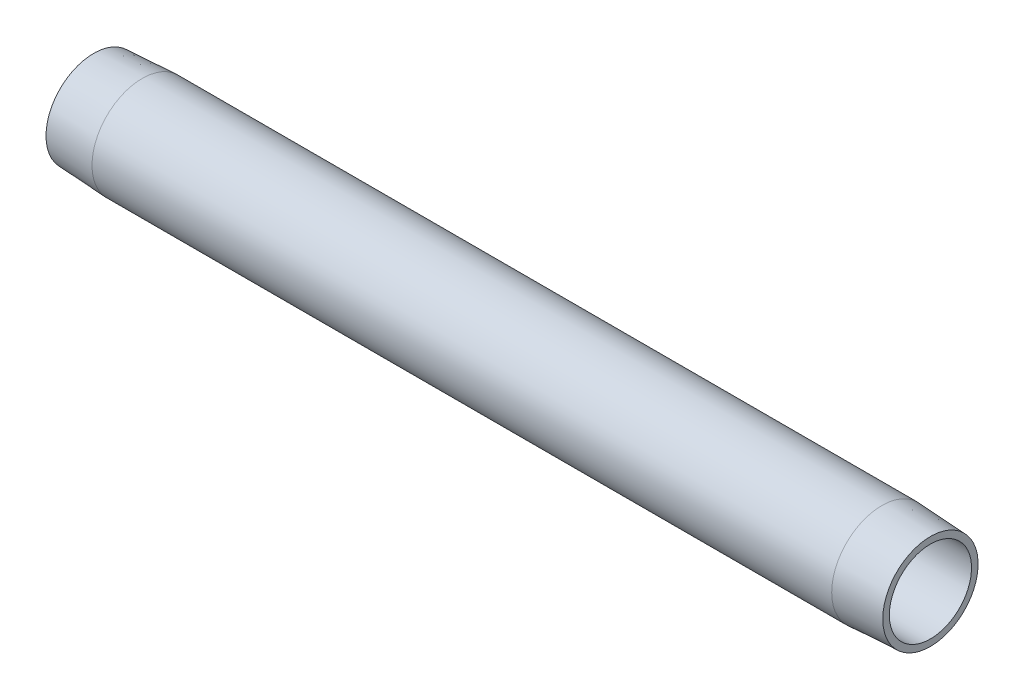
ISO-10303-21;
HEADER;
FILE_DESCRIPTION(('STEP AP214'),'2;1');
FILE_NAME('part.step','',(''),(''),'','','');
FILE_SCHEMA(('AUTOMOTIVE_DESIGN { 1 0 10303 214 1 1 1 1 }'));
ENDSEC;
DATA;
#1=APPLICATION_CONTEXT('core data for automotive mechanical design processes');
#2=APPLICATION_PROTOCOL_DEFINITION('international standard','automotive_design',2000,#1);
#3=PRODUCT_CONTEXT('',#1,'mechanical');
#4=PRODUCT('Part','Part','',(#3));
#5=PRODUCT_RELATED_PRODUCT_CATEGORY('part','',(#4));
#6=PRODUCT_DEFINITION_FORMATION('','',#4);
#7=PRODUCT_DEFINITION_CONTEXT('part definition',#1,'design');
#8=PRODUCT_DEFINITION('design','',#6,#7);
#9=PRODUCT_DEFINITION_SHAPE('','',#8);
#10=(LENGTH_UNIT() NAMED_UNIT(*) SI_UNIT(.MILLI.,.METRE.));
#11=(NAMED_UNIT(*) PLANE_ANGLE_UNIT() SI_UNIT($,.RADIAN.));
#12=(NAMED_UNIT(*) SI_UNIT($,.STERADIAN.) SOLID_ANGLE_UNIT());
#13=UNCERTAINTY_MEASURE_WITH_UNIT(LENGTH_MEASURE(1.E-05),#10,'distance_accuracy_value','');
#14=(GEOMETRIC_REPRESENTATION_CONTEXT(3) GLOBAL_UNCERTAINTY_ASSIGNED_CONTEXT((#13)) GLOBAL_UNIT_ASSIGNED_CONTEXT((#10,
#11,#12)) REPRESENTATION_CONTEXT('',''));
#15=CARTESIAN_POINT('',(0.,0.,0.));
#16=DIRECTION('',(0.,0.,1.));
#17=DIRECTION('',(1.,0.,0.));
#18=AXIS2_PLACEMENT_3D('',#15,#16,#17);
#19=CARTESIAN_POINT('',(177.8,8.73125000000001,0.));
#20=DIRECTION('',(-1.,0.,0.));
#21=DIRECTION('',(0.,0.,1.));
#22=AXIS2_PLACEMENT_3D('',#19,#20,#21);
#23=PLANE('',#22);
#24=CARTESIAN_POINT('',(177.8,0.,0.));
#25=DIRECTION('',(-1.,0.,0.));
#26=DIRECTION('',(0.,0.,1.));
#27=AXIS2_PLACEMENT_3D('',#24,#25,#26);
#28=CIRCLE('',#27,10.1275500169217);
#29=CARTESIAN_POINT('',(177.8,0.,10.1275500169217));
#30=VERTEX_POINT('',#29);
#31=EDGE_CURVE('E10',#30,#30,#28,.T.);
#32=ORIENTED_EDGE('',*,*,#31,.F.);
#33=EDGE_LOOP('',(#32));
#34=FACE_BOUND('',#33,.T.);
#35=CARTESIAN_POINT('',(177.8,0.,0.));
#36=DIRECTION('',(-1.,0.,0.));
#37=DIRECTION('',(0.,0.,1.));
#38=AXIS2_PLACEMENT_3D('',#35,#36,#37);
#39=CIRCLE('',#38,8.73125000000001);
#40=CARTESIAN_POINT('',(177.8,0.,8.73125000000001));
#41=VERTEX_POINT('',#40);
#42=EDGE_CURVE('E52',#41,#41,#39,.T.);
#43=ORIENTED_EDGE('',*,*,#42,.T.);
#44=EDGE_LOOP('',(#43));
#45=FACE_BOUND('',#44,.T.);
#46=ADVANCED_FACE('F30',(#34,#45),#23,.F.);
#47=CARTESIAN_POINT('',(177.8,0.,0.));
#48=DIRECTION('',(-1.,0.,0.));
#49=DIRECTION('',(0.,0.,1.));
#50=AXIS2_PLACEMENT_3D('',#47,#48,#49);
#51=CONICAL_SURFACE('',#50,10.1275500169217,0.0523598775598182);
#52=CARTESIAN_POINT('',(167.4876,0.,0.));
#53=DIRECTION('',(-1.,0.,0.));
#54=DIRECTION('',(0.,0.,1.));
#55=AXIS2_PLACEMENT_3D('',#52,#53,#54);
#56=CIRCLE('',#55,10.668);
#57=CARTESIAN_POINT('',(167.4876,0.,10.668));
#58=VERTEX_POINT('',#57);
#59=EDGE_CURVE('E36',#58,#58,#56,.T.);
#60=ORIENTED_EDGE('',*,*,#59,.F.);
#61=EDGE_LOOP('',(#60));
#62=FACE_BOUND('',#61,.T.);
#63=ORIENTED_EDGE('',*,*,#31,.T.);
#64=EDGE_LOOP('',(#63));
#65=FACE_BOUND('',#64,.T.);
#66=ADVANCED_FACE('F77',(#62,#65),#51,.T.);
#67=CARTESIAN_POINT('',(0.,0.,0.));
#68=DIRECTION('',(-1.,0.,0.));
#69=DIRECTION('',(0.,0.,1.));
#70=AXIS2_PLACEMENT_3D('',#67,#68,#69);
#71=CYLINDRICAL_SURFACE('',#70,10.668);
#72=CARTESIAN_POINT('',(10.3124,0.,0.));
#73=DIRECTION('',(-1.,0.,0.));
#74=DIRECTION('',(0.,0.,1.));
#75=AXIS2_PLACEMENT_3D('',#72,#73,#74);
#76=CIRCLE('',#75,10.668);
#77=CARTESIAN_POINT('',(10.3124,0.,10.668));
#78=VERTEX_POINT('',#77);
#79=EDGE_CURVE('E40',#78,#78,#76,.T.);
#80=ORIENTED_EDGE('',*,*,#79,.F.);
#81=EDGE_LOOP('',(#80));
#82=FACE_BOUND('',#81,.T.);
#83=ORIENTED_EDGE('',*,*,#59,.T.);
#84=EDGE_LOOP('',(#83));
#85=FACE_BOUND('',#84,.T.);
#86=ADVANCED_FACE('F72',(#82,#85),#71,.T.);
#87=CARTESIAN_POINT('',(10.3124,0.,0.));
#88=DIRECTION('',(1.,0.,0.));
#89=DIRECTION('',(0.,0.,-1.));
#90=AXIS2_PLACEMENT_3D('',#87,#88,#89);
#91=CONICAL_SURFACE('',#90,10.668,0.0523598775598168);
#92=CARTESIAN_POINT('',(0.,0.,0.));
#93=DIRECTION('',(-1.,0.,0.));
#94=DIRECTION('',(0.,0.,1.));
#95=AXIS2_PLACEMENT_3D('',#92,#93,#94);
#96=CIRCLE('',#95,10.1275500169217);
#97=CARTESIAN_POINT('',(0.,0.,10.1275500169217));
#98=VERTEX_POINT('',#97);
#99=EDGE_CURVE('E44',#98,#98,#96,.T.);
#100=ORIENTED_EDGE('',*,*,#99,.F.);
#101=EDGE_LOOP('',(#100));
#102=FACE_BOUND('',#101,.T.);
#103=ORIENTED_EDGE('',*,*,#79,.T.);
#104=EDGE_LOOP('',(#103));
#105=FACE_BOUND('',#104,.T.);
#106=ADVANCED_FACE('F66',(#102,#105),#91,.T.);
#107=CARTESIAN_POINT('',(0.,10.1275500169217,0.));
#108=DIRECTION('',(1.,0.,0.));
#109=DIRECTION('',(0.,0.,-1.));
#110=AXIS2_PLACEMENT_3D('',#107,#108,#109);
#111=PLANE('',#110);
#112=CARTESIAN_POINT('',(0.,0.,0.));
#113=DIRECTION('',(-1.,0.,0.));
#114=DIRECTION('',(0.,0.,1.));
#115=AXIS2_PLACEMENT_3D('',#112,#113,#114);
#116=CIRCLE('',#115,8.73125);
#117=CARTESIAN_POINT('',(0.,0.,8.73125));
#118=VERTEX_POINT('',#117);
#119=EDGE_CURVE('E49',#118,#118,#116,.T.);
#120=ORIENTED_EDGE('',*,*,#119,.F.);
#121=EDGE_LOOP('',(#120));
#122=FACE_BOUND('',#121,.T.);
#123=ORIENTED_EDGE('',*,*,#99,.T.);
#124=EDGE_LOOP('',(#123));
#125=FACE_BOUND('',#124,.T.);
#126=ADVANCED_FACE('F60',(#122,#125),#111,.F.);
#127=CARTESIAN_POINT('',(0.,0.,0.));
#128=DIRECTION('',(-1.,0.,0.));
#129=DIRECTION('',(0.,0.,1.));
#130=AXIS2_PLACEMENT_3D('',#127,#128,#129);
#131=CYLINDRICAL_SURFACE('',#130,8.73125);
#132=ORIENTED_EDGE('',*,*,#42,.F.);
#133=EDGE_LOOP('',(#132));
#134=FACE_BOUND('',#133,.T.);
#135=ORIENTED_EDGE('',*,*,#119,.T.);
#136=EDGE_LOOP('',(#135));
#137=FACE_BOUND('',#136,.T.);
#138=ADVANCED_FACE('F57',(#134,#137),#131,.F.);
#139=CLOSED_SHELL('',(#46,#66,#86,#106,#126,#138));
#140=MANIFOLD_SOLID_BREP('B2',#139);
#141=ADVANCED_BREP_SHAPE_REPRESENTATION('',(#18,#140),#14);
#142=SHAPE_DEFINITION_REPRESENTATION(#9,#141);
ENDSEC;
END-ISO-10303-21;
